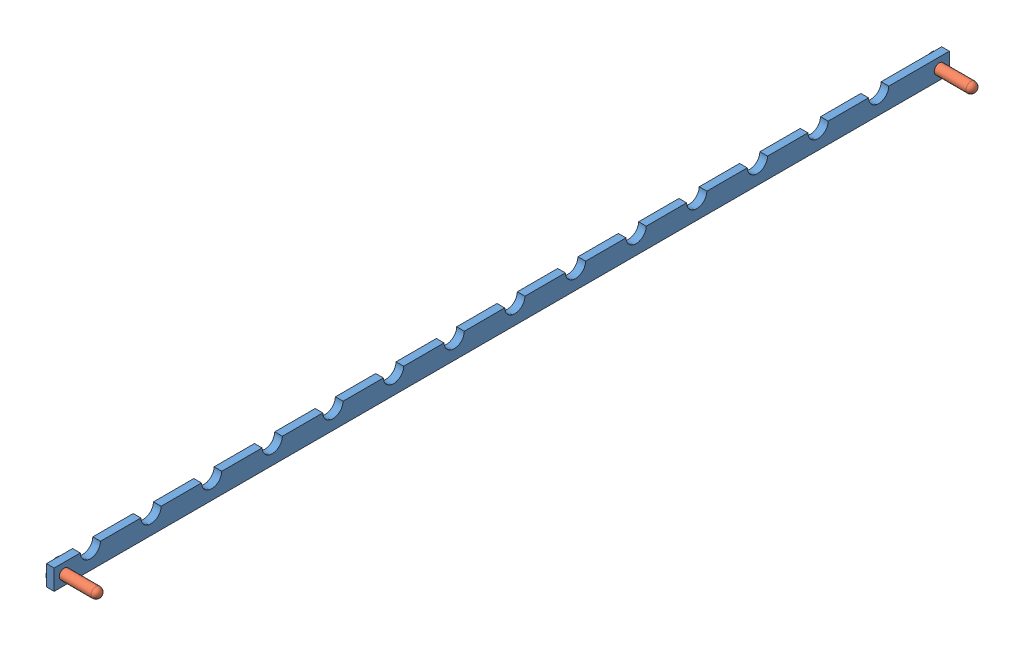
SolidWorks assembly BRAZO SUJETADOR ALUMINIO CON REMACHES.SLDASM, configuration Predeterminado (file format 4400). Lengths in mm.
Overall size (30 13.3 561.6).
3 component instances, 2 part files, 4 mates.
Components (placement in the parent):
- BRAZO SUJETADOR ALUMINIO-1: BRAZO SUJETADOR ALUMINIO.SLDPRT [Predeterminado] at (-5.4243 6.6704 0) size (4.8 12.7 561)
- REMACHE DE 1-4-1: REMACHE DE 1-4.SLDPRT [Predeterminado] at (11.8821 7.1987 -554.65) x (0 0 -1) z (1 0 0) size (13.3 13.3 30)
- REMACHE DE 1-4-2: REMACHE DE 1-4.SLDPRT [Predeterminado] at (11.8821 7.1987 -6.35) x (0 0 -1) z (1 0 0) size (13.3 13.3 30)
Mates (geometry in assembly coordinates):
- Coincidente1: coincident anti-aligned: plane of BRAZO SUJETADOR ALUMINIO-1 through (-5.4243 -6.0296 0) normal (-1 0 0); plane of REMACHE DE 1-4-1 through (-5.4243 -2.8296 -554.65) normal (1 0 0)
- Coincidente2: coincident anti-aligned: axis of BRAZO SUJETADOR ALUMINIO-1 through (-5.4243 0.3204 -554.65) axis (1 0 0); axis of REMACHE DE 1-4-1 through (-2.7844 0.3204 -554.65) axis (-1 0 0)
- Coincidente3: coincident anti-aligned: plane of BRAZO SUJETADOR ALUMINIO-1 through (-5.4243 -6.0296 0) normal (-1 0 0); plane of REMACHE DE 1-4-2 through (-5.4243 -2.8296 -6.35) normal (1 0 0)
- Coincidente4: coincident anti-aligned: axis of BRAZO SUJETADOR ALUMINIO-1 through (-5.4243 0.3204 -6.35) axis (1 0 0); axis of REMACHE DE 1-4-2 through (-2.7844 0.3204 -6.35) axis (-1 0 0)
